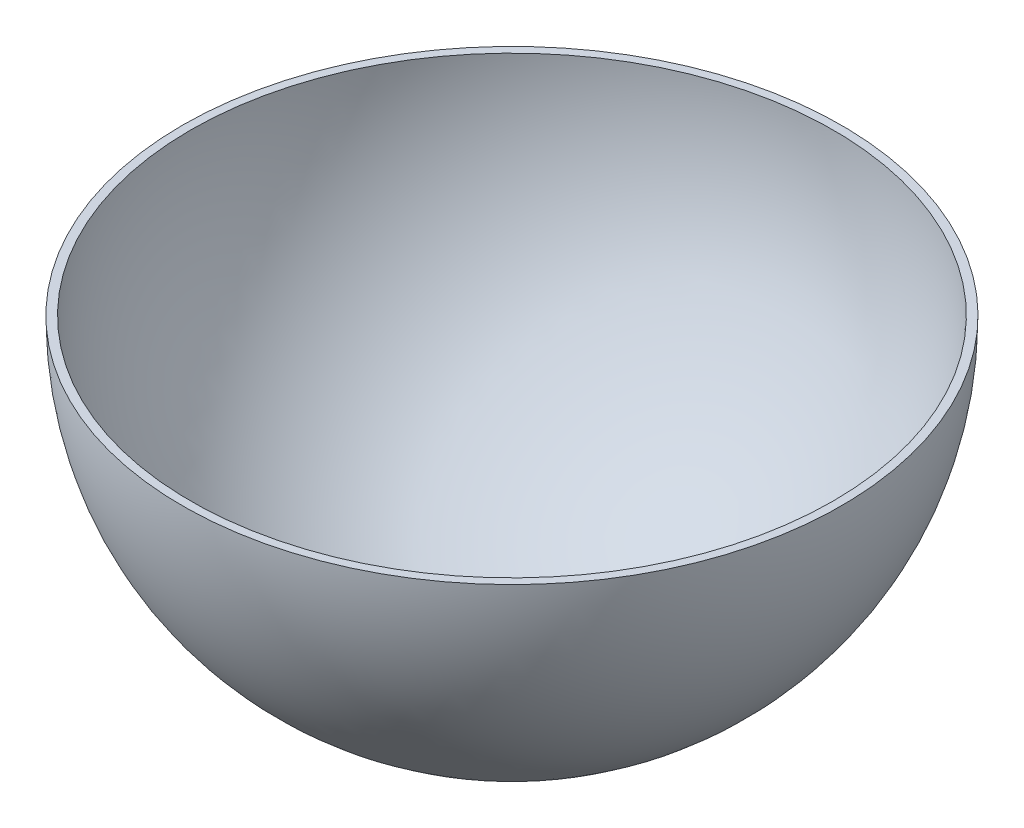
ISO-10303-21;
HEADER;
FILE_DESCRIPTION(('STEP AP214'),'2;1');
FILE_NAME('part.step','',(''),(''),'','','');
FILE_SCHEMA(('AUTOMOTIVE_DESIGN { 1 0 10303 214 1 1 1 1 }'));
ENDSEC;
DATA;
#1=APPLICATION_CONTEXT('core data for automotive mechanical design processes');
#2=APPLICATION_PROTOCOL_DEFINITION('international standard','automotive_design',2000,#1);
#3=PRODUCT_CONTEXT('',#1,'mechanical');
#4=PRODUCT('Part','Part','',(#3));
#5=PRODUCT_RELATED_PRODUCT_CATEGORY('part','',(#4));
#6=PRODUCT_DEFINITION_FORMATION('','',#4);
#7=PRODUCT_DEFINITION_CONTEXT('part definition',#1,'design');
#8=PRODUCT_DEFINITION('design','',#6,#7);
#9=PRODUCT_DEFINITION_SHAPE('','',#8);
#10=(LENGTH_UNIT() NAMED_UNIT(*) SI_UNIT(.MILLI.,.METRE.));
#11=(NAMED_UNIT(*) PLANE_ANGLE_UNIT() SI_UNIT($,.RADIAN.));
#12=(NAMED_UNIT(*) SI_UNIT($,.STERADIAN.) SOLID_ANGLE_UNIT());
#13=UNCERTAINTY_MEASURE_WITH_UNIT(LENGTH_MEASURE(1.E-05),#10,'distance_accuracy_value','');
#14=(GEOMETRIC_REPRESENTATION_CONTEXT(3) GLOBAL_UNCERTAINTY_ASSIGNED_CONTEXT((#13)) GLOBAL_UNIT_ASSIGNED_CONTEXT((#10,
#11,#12)) REPRESENTATION_CONTEXT('',''));
#15=CARTESIAN_POINT('',(0.,0.,0.));
#16=DIRECTION('',(0.,0.,1.));
#17=DIRECTION('',(1.,0.,0.));
#18=AXIS2_PLACEMENT_3D('',#15,#16,#17);
#19=CARTESIAN_POINT('',(0.,0.,0.));
#20=DIRECTION('',(1.,0.,0.));
#21=DIRECTION('',(0.,0.,-1.));
#22=AXIS2_PLACEMENT_3D('',#19,#20,#21);
#23=SPHERICAL_SURFACE('',#22,39.);
#24=CARTESIAN_POINT('',(0.,0.,0.));
#25=DIRECTION('',(0.,1.,0.));
#26=DIRECTION('',(1.,0.,0.));
#27=AXIS2_PLACEMENT_3D('',#24,#25,#26);
#28=SPHERICAL_SURFACE('',#27,39.);
#29=CARTESIAN_POINT('',(0.,0.,0.));
#30=DIRECTION('',(0.,1.,0.));
#31=DIRECTION('',(1.,0.,0.));
#32=AXIS2_PLACEMENT_3D('',#29,#30,#31);
#33=CIRCLE('',#32,39.);
#34=CARTESIAN_POINT('',(39.,0.,0.));
#35=VERTEX_POINT('',#34);
#36=EDGE_CURVE('E44',#35,#35,#33,.F.);
#37=ORIENTED_EDGE('',*,*,#36,.F.);
#38=EDGE_LOOP('',(#37));
#39=FACE_BOUND('',#38,.T.);
#40=ADVANCED_FACE('F37',(#39),#28,.F.);
#41=CARTESIAN_POINT('',(0.,0.,0.));
#42=DIRECTION('',(1.,0.,0.));
#43=DIRECTION('',(0.,0.,-1.));
#44=AXIS2_PLACEMENT_3D('',#41,#42,#43);
#45=SPHERICAL_SURFACE('',#44,40.);
#46=CARTESIAN_POINT('',(0.,0.,0.));
#47=DIRECTION('',(0.,-1.,0.));
#48=DIRECTION('',(-1.,0.,0.));
#49=AXIS2_PLACEMENT_3D('',#46,#47,#48);
#50=SPHERICAL_SURFACE('',#49,40.);
#51=CARTESIAN_POINT('',(0.,0.,0.));
#52=DIRECTION('',(0.,-1.,0.));
#53=DIRECTION('',(-1.,0.,0.));
#54=AXIS2_PLACEMENT_3D('',#51,#52,#53);
#55=CIRCLE('',#54,40.);
#56=CARTESIAN_POINT('',(-40.,0.,0.));
#57=VERTEX_POINT('',#56);
#58=EDGE_CURVE('E10',#57,#57,#55,.T.);
#59=ORIENTED_EDGE('',*,*,#58,.T.);
#60=EDGE_LOOP('',(#59));
#61=FACE_BOUND('',#60,.T.);
#62=ADVANCED_FACE('F39',(#61),#50,.T.);
#63=CARTESIAN_POINT('',(0.,0.,0.));
#64=DIRECTION('',(0.,1.,0.));
#65=DIRECTION('',(1.,0.,0.));
#66=AXIS2_PLACEMENT_3D('',#63,#64,#65);
#67=PLANE('',#66);
#68=ORIENTED_EDGE('',*,*,#36,.T.);
#69=EDGE_LOOP('',(#68));
#70=FACE_BOUND('',#69,.T.);
#71=ORIENTED_EDGE('',*,*,#58,.F.);
#72=EDGE_LOOP('',(#71));
#73=FACE_BOUND('',#72,.T.);
#74=ADVANCED_FACE('F50',(#70,#73),#67,.T.);
#75=CLOSED_SHELL('',(#40,#62,#74));
#76=MANIFOLD_SOLID_BREP('B2',#75);
#77=ADVANCED_BREP_SHAPE_REPRESENTATION('',(#18,#76),#14);
#78=SHAPE_DEFINITION_REPRESENTATION(#9,#77);
ENDSEC;
END-ISO-10303-21;
